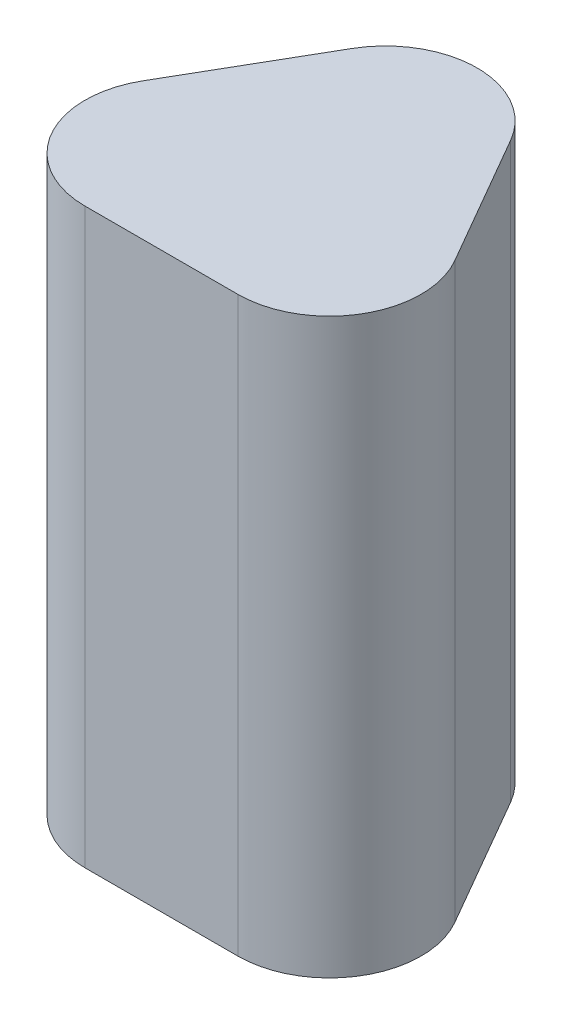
from build123d import *

# Parameters (mm, degrees)
EXTRUDE_1_DEPTH     = 75
CUT_EXTRUDE_1_DEPTH = 72
CUT_EXTRUDE_2_DEPTH = 2.5
SKETCH_4_R          = 2.6
CUT_EXTRUDE_3_DEPTH = 2


with BuildPart() as part:
    # Sketch 1 → Extrude 1 (new body)
    with BuildSketch(Plane(origin=(0, 0, 0), x_dir=(1, 0, 0), z_dir=(0, 1, 0))):
        with BuildLine():
            Line((10.392304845, 17.547005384), (20.392304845, 0.226497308))
            ThreePointArc((20.392304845, 0.226497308), (20.392304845, -11.773502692), (10, -17.773502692))
            Line((10, -17.773502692), (-10, -17.773502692))
            ThreePointArc((-10, -17.773502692), (-20.392304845, -11.773502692), (-20.392304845, 0.226497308))
            Line((-20.392304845, 0.226497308), (-10.392304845, 17.547005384))
            ThreePointArc((-10.392304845, 17.547005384), (0, 23.547005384), (10.392304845, 17.547005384))
        make_face()
    extrude(amount=EXTRUDE_1_DEPTH)

    # Sketch 2 → Cut-Extrude 1 (cut)
    with BuildSketch(Plane.XZ):
        with BuildLine():
            Line((-10, 15.273502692), (10, 15.273502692))
            ThreePointArc((10, 15.273502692), (18.227241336, 10.523502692), (18.227241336, 1.023502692))
            Line((18.227241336, 1.023502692), (8.227241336, -16.297005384))
            ThreePointArc((8.227241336, -16.297005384), (0, -21.047005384), (-8.227241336, -16.297005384))
            Line((-8.227241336, -16.297005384), (-18.227241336, 1.023502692))
            ThreePointArc((-18.227241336, 1.023502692), (-18.227241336, 10.523502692), (-10, 15.273502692))
        make_face()
    extrude(amount=-CUT_EXTRUDE_1_DEPTH, mode=Mode.SUBTRACT)

    # Sketch 3 → Cut-Extrude 2 (cut)
    with BuildSketch(Plane.XZ):
        with BuildLine():
            Line((9.309773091, -16.922005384), (19.309773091, 0.398502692))
            ThreePointArc((19.309773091, 0.398502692), (19.309773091, 11.148502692), (10, 16.523502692))
            Line((10, 16.523502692), (-10, 16.523502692))
            ThreePointArc((-10, 16.523502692), (-19.309773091, 11.148502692), (-19.309773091, 0.398502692))
            Line((-19.309773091, 0.398502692), (-9.309773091, -16.922005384))
            ThreePointArc((-9.309773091, -16.922005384), (0, -22.297005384), (9.309773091, -16.922005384))
        make_face()
    extrude(amount=-CUT_EXTRUDE_2_DEPTH, mode=Mode.SUBTRACT)

    # Sketch 4 → Cut-Extrude 3 (cut)
    with BuildSketch(Plane.XZ.offset(-72)):
        with Locations(Location((0, 12, 0), (0, 0, 270))):
            Circle(SKETCH_4_R)
        with Locations(Location((-10.392304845, -6, 0), (0, 0, 270))):
            Circle(SKETCH_4_R)
        with Locations(Location((10.392304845, -6, 0), (0, 0, 270))):
            Circle(SKETCH_4_R)
    extrude(amount=-CUT_EXTRUDE_3_DEPTH, mode=Mode.SUBTRACT)


solid = part.part
